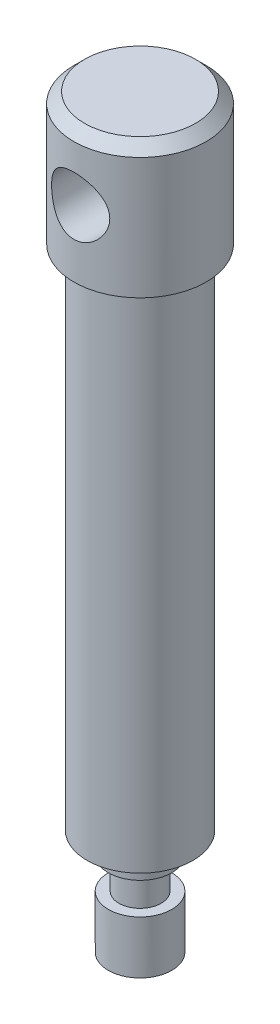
from build123d import *

# Parameters (mm, degrees)
CUT_EXTRUDE1_DEPTH      = 146.54166639
CUT_EXTRUDE1_DEPTH_BACK = 146.54166639
SKETCH2_R               = 5.5
CHAMFER1_SIZE           = 2


with BuildPart() as part:
    # Sketch1 → Revolve1 (revolve)
    with BuildSketch(Plane.XY, mode=Mode.PRIVATE) as revolve1_sk:
        Polygon((0, 0), (6, 3.464101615), (6, 13.464101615), (4, 13.464101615), (4, 19.464101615), (6, 19.464101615), (6, 23.464101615), (10, 23.464101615), (10, 119.464101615), (12.5, 119.464101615), (12.5, 144.464101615), (0, 144.464101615), align=None)
    revolve(revolve1_sk.sketch.rotate(Axis((0, 0, 0), (0, 1, 0)), 90), axis=Axis((0, 0, 0), (0, 1, 0)))

    # Sketch2 → Cut-Extrude1 (cut, two sides: drawn at the far end of the back side and taken through both)
    with BuildSketch(Plane.XY.offset(-CUT_EXTRUDE1_DEPTH_BACK)):
        with Locations((0, 131.964101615)):
            Circle(SKETCH2_R)
    extrude(amount=CUT_EXTRUDE1_DEPTH + CUT_EXTRUDE1_DEPTH_BACK, mode=Mode.SUBTRACT)

    # Chamfer1
    chamfer1_edges = [part.edges().sort_by_distance(p)[0] for p in [
        (0, 144.464101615, 12.5),
    ]]
    chamfer(chamfer1_edges, length=CHAMFER1_SIZE)


solid = part.part
